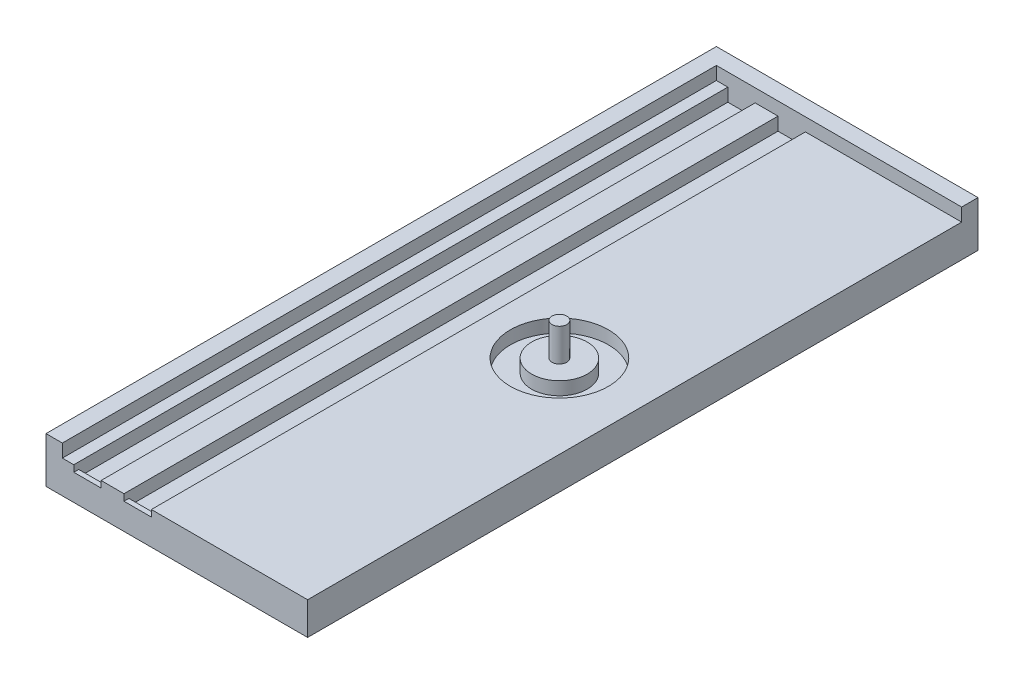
from build123d import *

# Parameters (mm, degrees)
SKETCH2_W           = 80
SKETCH2_H           = 205
BOSS_EXTRUDE1_DEPTH = 10
BOSS_EXTRUDE2_DEPTH = 4
SKETCH6_W           = 8.35
SKETCH6_H           = 200
SKETCH6_W_2         = 8.37
CUT_EXTRUDE2_DEPTH  = 4
SKETCH7_R           = 15
SKETCH7_R_2         = 8.5
CUT_EXTRUDE3_DEPTH  = 4
SKETCH8_R           = 2.25
BOSS_EXTRUDE3_DEPTH = 10
SKETCH9_W           = 8.37
SKETCH9_H           = 2
SKETCH9_W_2         = 8.35
BOSS_EXTRUDE4_DEPTH = 1.5


with BuildPart() as part:
    # Sketch2 → Boss-Extrude1 (new body)
    with BuildSketch(Plane(origin=(0, 0, 0), x_dir=(1, 0, 0), z_dir=(0, 1, 0))):
        Rectangle(SKETCH2_W, SKETCH2_H)
    extrude(amount=BOSS_EXTRUDE1_DEPTH)

    # Sketch5 → Boss-Extrude2 (add)
    with BuildSketch(Plane(origin=(0, 10, 0), x_dir=(1, 0, 0), z_dir=(0, 1, 0))):
        Polygon((40, 97.5), (-35, 97.5), (-35, -102.5), (-40, -102.5), (-40, 102.5), (40, 102.5), align=None)
    extrude(amount=BOSS_EXTRUDE2_DEPTH)

    # Sketch6 → Cut-Extrude2 (cut)
    with BuildSketch(Plane(origin=(0, 10, 0), x_dir=(1, 0, 0), z_dir=(0, 1, 0))):
        with Locations((-27.325, -2.5)):
            Rectangle(SKETCH6_W, SKETCH6_H)
        with Locations((-11.965, -2.5)):
            Rectangle(SKETCH6_W_2, SKETCH6_H)
    extrude(amount=-CUT_EXTRUDE2_DEPTH, mode=Mode.SUBTRACT)

    # Sketch7 → Cut-Extrude3 (cut)
    with BuildSketch(Plane(origin=(0, 10, 0), x_dir=(1, 0, 0), z_dir=(0, 1, 0))):
        with Locations(Location((14.5, 0, 0), (0, 0, 270))):
            Circle(SKETCH7_R)
        with Locations(Location((14.5, 0, 0), (0, 0, 270))):
            Circle(SKETCH7_R_2, mode=Mode.SUBTRACT)
    extrude(amount=-CUT_EXTRUDE3_DEPTH, mode=Mode.SUBTRACT)

    # Sketch8 → Boss-Extrude3 (add)
    with BuildSketch(Plane(origin=(0, 10, 0), x_dir=(1, 0, 0), z_dir=(0, 1, 0))):
        with Locations(Location((14.5, 0, 0), (0, 0, 270))):
            Circle(SKETCH8_R)
    extrude(amount=BOSS_EXTRUDE3_DEPTH)

    # Sketch9 → Boss-Extrude4 (add)
    with BuildSketch(Plane.XY.offset(102.5)):
        with Locations((-11.965, 7)):
            Rectangle(SKETCH9_W, SKETCH9_H)
        with Locations((-27.325, 7)):
            Rectangle(SKETCH9_W_2, SKETCH9_H)
    extrude(amount=-BOSS_EXTRUDE4_DEPTH)


solid = part.part
